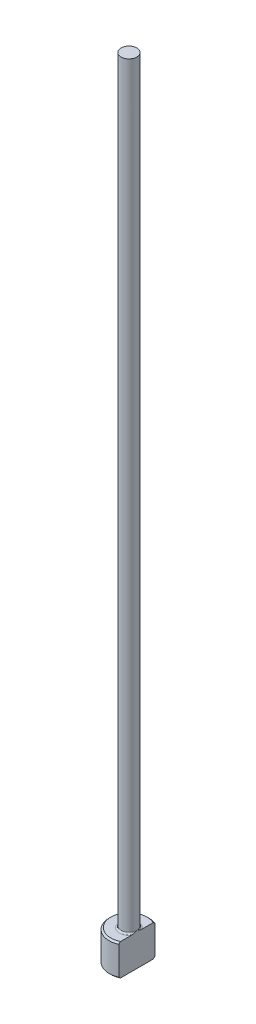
ISO-10303-21;
HEADER;
FILE_DESCRIPTION(('STEP AP214'),'2;1');
FILE_NAME('part.step','',(''),(''),'','','');
FILE_SCHEMA(('AUTOMOTIVE_DESIGN { 1 0 10303 214 1 1 1 1 }'));
ENDSEC;
DATA;
#1=APPLICATION_CONTEXT('core data for automotive mechanical design processes');
#2=APPLICATION_PROTOCOL_DEFINITION('international standard','automotive_design',2000,#1);
#3=PRODUCT_CONTEXT('',#1,'mechanical');
#4=PRODUCT('Part','Part','',(#3));
#5=PRODUCT_RELATED_PRODUCT_CATEGORY('part','',(#4));
#6=PRODUCT_DEFINITION_FORMATION('','',#4);
#7=PRODUCT_DEFINITION_CONTEXT('part definition',#1,'design');
#8=PRODUCT_DEFINITION('design','',#6,#7);
#9=PRODUCT_DEFINITION_SHAPE('','',#8);
#10=(LENGTH_UNIT() NAMED_UNIT(*) SI_UNIT(.MILLI.,.METRE.));
#11=(NAMED_UNIT(*) PLANE_ANGLE_UNIT() SI_UNIT($,.RADIAN.));
#12=(NAMED_UNIT(*) SI_UNIT($,.STERADIAN.) SOLID_ANGLE_UNIT());
#13=UNCERTAINTY_MEASURE_WITH_UNIT(LENGTH_MEASURE(1.E-05),#10,'distance_accuracy_value','');
#14=(GEOMETRIC_REPRESENTATION_CONTEXT(3) GLOBAL_UNCERTAINTY_ASSIGNED_CONTEXT((#13)) GLOBAL_UNIT_ASSIGNED_CONTEXT((#10,
#11,#12)) REPRESENTATION_CONTEXT('',''));
#15=CARTESIAN_POINT('',(0.,0.,0.));
#16=DIRECTION('',(0.,0.,1.));
#17=DIRECTION('',(1.,0.,0.));
#18=AXIS2_PLACEMENT_3D('',#15,#16,#17);
#19=CARTESIAN_POINT('',(0.,0.,0.));
#20=DIRECTION('',(0.,-1.,0.));
#21=DIRECTION('',(0.,0.,-1.));
#22=AXIS2_PLACEMENT_3D('',#19,#20,#21);
#23=PLANE('',#22);
#24=CARTESIAN_POINT('',(0.,0.,0.));
#25=DIRECTION('',(0.,-1.,0.));
#26=DIRECTION('',(0.,0.,-1.));
#27=AXIS2_PLACEMENT_3D('',#24,#25,#26);
#28=CIRCLE('',#27,2.29999999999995);
#29=CARTESIAN_POINT('',(0.999999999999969,0.,2.07123151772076));
#30=VERTEX_POINT('',#29);
#31=CARTESIAN_POINT('',(0.999999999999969,0.,-2.07123151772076));
#32=VERTEX_POINT('',#31);
#33=EDGE_CURVE('E98',#30,#32,#28,.T.);
#34=ORIENTED_EDGE('',*,*,#33,.T.);
#35=DIRECTION('',(0.,0.,1.));
#36=VECTOR('',#35,1.);
#37=CARTESIAN_POINT('',(0.999999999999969,0.,2.2912878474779));
#38=LINE('',#37,#36);
#39=EDGE_CURVE('E83',#32,#30,#38,.T.);
#40=ORIENTED_EDGE('',*,*,#39,.T.);
#41=EDGE_LOOP('',(#34,#40));
#42=FACE_BOUND('',#41,.T.);
#43=ADVANCED_FACE('F32',(#42),#23,.T.);
#44=CARTESIAN_POINT('',(0.,259.958771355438,0.));
#45=DIRECTION('',(0.,1.,0.));
#46=DIRECTION('',(0.,0.,1.));
#47=AXIS2_PLACEMENT_3D('',#44,#45,#46);
#48=CYLINDRICAL_SURFACE('',#47,2.49999999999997);
#49=CARTESIAN_POINT('',(0.,3.80000000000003,0.));
#50=DIRECTION('',(0.,1.,0.));
#51=DIRECTION('',(0.,0.,1.));
#52=AXIS2_PLACEMENT_3D('',#49,#50,#51);
#53=CIRCLE('',#52,2.49999999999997);
#54=CARTESIAN_POINT('',(0.999999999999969,3.80000000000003,2.2912878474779));
#55=VERTEX_POINT('',#54);
#56=CARTESIAN_POINT('',(0.999999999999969,3.80000000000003,-2.2912878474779));
#57=VERTEX_POINT('',#56);
#58=EDGE_CURVE('E104',#55,#57,#53,.F.);
#59=ORIENTED_EDGE('',*,*,#58,.T.);
#60=DIRECTION('',(0.,-1.,0.));
#61=VECTOR('',#60,1.);
#62=CARTESIAN_POINT('',(0.999999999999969,100.,-2.2912878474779));
#63=LINE('',#62,#61);
#64=CARTESIAN_POINT('',(0.999999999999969,0.200000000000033,-2.2912878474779));
#65=VERTEX_POINT('',#64);
#66=EDGE_CURVE('E183',#57,#65,#63,.T.);
#67=ORIENTED_EDGE('',*,*,#66,.T.);
#68=CARTESIAN_POINT('',(0.,0.200000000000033,0.));
#69=DIRECTION('',(0.,-1.,0.));
#70=DIRECTION('',(0.,0.,-1.));
#71=AXIS2_PLACEMENT_3D('',#68,#69,#70);
#72=CIRCLE('',#71,2.49999999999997);
#73=CARTESIAN_POINT('',(0.999999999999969,0.200000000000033,2.2912878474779));
#74=VERTEX_POINT('',#73);
#75=EDGE_CURVE('E100',#65,#74,#72,.F.);
#76=ORIENTED_EDGE('',*,*,#75,.T.);
#77=DIRECTION('',(0.,-1.,0.));
#78=VECTOR('',#77,1.);
#79=CARTESIAN_POINT('',(0.999999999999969,100.,2.2912878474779));
#80=LINE('',#79,#78);
#81=EDGE_CURVE('E93',#55,#74,#80,.T.);
#82=ORIENTED_EDGE('',*,*,#81,.F.);
#83=EDGE_LOOP('',(#59,#67,#76,#82));
#84=FACE_BOUND('',#83,.T.);
#85=ADVANCED_FACE('F158',(#84),#48,.T.);
#86=CARTESIAN_POINT('',(-2.49999999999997,4.,0.));
#87=DIRECTION('',(0.,1.,0.));
#88=DIRECTION('',(0.,0.,1.));
#89=AXIS2_PLACEMENT_3D('',#86,#87,#88);
#90=PLANE('',#89);
#91=CARTESIAN_POINT('',(0.,4.,0.));
#92=DIRECTION('',(0.,1.,0.));
#93=DIRECTION('',(0.,0.,1.));
#94=AXIS2_PLACEMENT_3D('',#91,#92,#93);
#95=CIRCLE('',#94,2.29999999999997);
#96=CARTESIAN_POINT('',(0.999999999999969,4.,-2.07123151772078));
#97=VERTEX_POINT('',#96);
#98=CARTESIAN_POINT('',(0.999999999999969,4.,2.07123151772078));
#99=VERTEX_POINT('',#98);
#100=EDGE_CURVE('E178',#97,#99,#95,.T.);
#101=ORIENTED_EDGE('',*,*,#100,.T.);
#102=DIRECTION('',(0.,0.,-1.));
#103=VECTOR('',#102,1.);
#104=CARTESIAN_POINT('',(0.999999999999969,4.,0.));
#105=LINE('',#104,#103);
#106=CARTESIAN_POINT('',(0.999999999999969,3.99999999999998,0.663324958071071));
#107=VERTEX_POINT('',#106);
#108=EDGE_CURVE('E57',#99,#107,#105,.T.);
#109=ORIENTED_EDGE('',*,*,#108,.T.);
#110=CARTESIAN_POINT('',(0.,4.,0.));
#111=DIRECTION('',(0.,1.,0.));
#112=DIRECTION('',(0.,0.,1.));
#113=AXIS2_PLACEMENT_3D('',#110,#111,#112);
#114=CIRCLE('',#113,1.19999999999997);
#115=CARTESIAN_POINT('',(0.999999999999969,3.99999999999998,-0.663324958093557));
#116=VERTEX_POINT('',#115);
#117=EDGE_CURVE('E107',#107,#116,#114,.F.);
#118=ORIENTED_EDGE('',*,*,#117,.T.);
#119=EDGE_CURVE('E136',#116,#97,#105,.T.);
#120=ORIENTED_EDGE('',*,*,#119,.T.);
#121=EDGE_LOOP('',(#101,#109,#118,#120));
#122=FACE_BOUND('',#121,.T.);
#123=ADVANCED_FACE('F147',(#122),#90,.T.);
#124=CARTESIAN_POINT('',(0.,4.,0.));
#125=DIRECTION('',(0.,-1.,0.));
#126=DIRECTION('',(0.,0.,-1.));
#127=AXIS2_PLACEMENT_3D('',#124,#125,#126);
#128=CONICAL_SURFACE('',#127,2.29999999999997,0.785398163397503);
#129=ORIENTED_EDGE('',*,*,#58,.F.);
#130=CARTESIAN_POINT('',(0.999999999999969,1.15817039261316,5.043650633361));
#131=CARTESIAN_POINT('',(0.999999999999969,1.28171614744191,4.91769392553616));
#132=CARTESIAN_POINT('',(0.999999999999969,1.40517853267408,4.79165523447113));
#133=CARTESIAN_POINT('',(0.999999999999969,1.65205736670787,4.5391725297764));
#134=CARTESIAN_POINT('',(0.999999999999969,1.77547348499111,4.4127281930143));
#135=CARTESIAN_POINT('',(0.999999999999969,2.02507999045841,4.1564175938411));
#136=CARTESIAN_POINT('',(0.999999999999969,2.15126317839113,4.02654431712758));
#137=CARTESIAN_POINT('',(0.999999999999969,2.40304621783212,3.76660249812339));
#138=CARTESIAN_POINT('',(0.999999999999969,2.52864665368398,3.63653452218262));
#139=CARTESIAN_POINT('',(0.999999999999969,2.76776970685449,3.38787610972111));
#140=CARTESIAN_POINT('',(0.999999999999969,2.88133977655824,3.26933134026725));
#141=CARTESIAN_POINT('',(0.999999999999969,3.10787167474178,3.03166264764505));
#142=CARTESIAN_POINT('',(0.999999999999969,3.22083350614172,2.91253872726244));
#143=CARTESIAN_POINT('',(0.999999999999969,3.44656995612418,2.67277252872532));
#144=CARTESIAN_POINT('',(0.999999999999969,3.5593394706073,2.55212543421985));
#145=CARTESIAN_POINT('',(0.999999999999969,3.78351625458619,2.30972256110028));
#146=CARTESIAN_POINT('',(0.999999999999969,3.89492439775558,2.18796759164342));
#147=CARTESIAN_POINT('',(0.999999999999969,4.1131873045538,1.9454858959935));
#148=CARTESIAN_POINT('',(0.999999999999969,4.2200877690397,1.82480064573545));
#149=CARTESIAN_POINT('',(0.999999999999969,4.37813361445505,1.64149718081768));
#150=CARTESIAN_POINT('',(0.999999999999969,4.43049954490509,1.57993333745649));
#151=CARTESIAN_POINT('',(0.999999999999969,4.53410631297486,1.45586813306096));
#152=CARTESIAN_POINT('',(0.999999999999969,4.58534721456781,1.39336682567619));
#153=CARTESIAN_POINT('',(0.999999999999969,4.68568582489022,1.26783988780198));
#154=CARTESIAN_POINT('',(0.999999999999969,4.73480144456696,1.20482863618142));
#155=CARTESIAN_POINT('',(0.999999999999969,4.83086890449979,1.07709082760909));
#156=CARTESIAN_POINT('',(0.999999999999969,4.87781921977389,1.01236311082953));
#157=CARTESIAN_POINT('',(0.999999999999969,4.96818560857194,0.880911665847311));
#158=CARTESIAN_POINT('',(0.999999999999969,5.01161706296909,0.814198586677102));
#159=CARTESIAN_POINT('',(0.999999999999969,5.09325231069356,0.677671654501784));
#160=CARTESIAN_POINT('',(0.999999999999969,5.1314648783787,0.60786327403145));
#161=CARTESIAN_POINT('',(0.999999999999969,5.1726089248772,0.520757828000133));
#162=CARTESIAN_POINT('',(0.999999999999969,5.17963219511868,0.505387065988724));
#163=CARTESIAN_POINT('',(0.999999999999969,5.19324475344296,0.474448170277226));
#164=CARTESIAN_POINT('',(0.999999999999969,5.19983388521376,0.458879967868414));
#165=CARTESIAN_POINT('',(0.999999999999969,5.21887613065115,0.411884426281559));
#166=CARTESIAN_POINT('',(0.999999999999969,5.23060772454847,0.380158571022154));
#167=CARTESIAN_POINT('',(0.999999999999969,5.25156131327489,0.316410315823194));
#168=CARTESIAN_POINT('',(0.999999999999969,5.26081845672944,0.284399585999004));
#169=CARTESIAN_POINT('',(0.999999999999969,5.2766313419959,0.21969696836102));
#170=CARTESIAN_POINT('',(0.999999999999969,5.2831862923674,0.187004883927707));
#171=CARTESIAN_POINT('',(0.999999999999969,5.29332210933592,0.120434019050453));
#172=CARTESIAN_POINT('',(0.999999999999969,5.29683603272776,0.0865448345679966));
#173=CARTESIAN_POINT('',(0.999999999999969,5.30040235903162,0.018593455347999));
#174=CARTESIAN_POINT('',(0.999999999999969,5.30045600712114,-0.0154686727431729));
#175=CARTESIAN_POINT('',(0.999999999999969,5.29709918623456,-0.0834515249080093));
#176=CARTESIAN_POINT('',(0.999999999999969,5.29368537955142,-0.117372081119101));
#177=CARTESIAN_POINT('',(0.999999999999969,5.28362616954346,-0.184734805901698));
#178=CARTESIAN_POINT('',(0.999999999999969,5.27697933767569,-0.218176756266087));
#179=CARTESIAN_POINT('',(0.999999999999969,5.25861838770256,-0.293522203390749));
#180=CARTESIAN_POINT('',(0.999999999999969,5.24601100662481,-0.335206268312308));
#181=CARTESIAN_POINT('',(0.999999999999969,5.21711806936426,-0.417267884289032));
#182=CARTESIAN_POINT('',(0.999999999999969,5.20083078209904,-0.457644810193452));
#183=CARTESIAN_POINT('',(0.999999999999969,5.16531625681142,-0.53739243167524));
#184=CARTESIAN_POINT('',(0.999999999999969,5.14606996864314,-0.576754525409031));
#185=CARTESIAN_POINT('',(0.999999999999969,5.10541239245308,-0.654316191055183));
#186=CARTESIAN_POINT('',(0.999999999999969,5.08400173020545,-0.692516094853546));
#187=CARTESIAN_POINT('',(0.999999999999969,5.03811272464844,-0.770330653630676));
#188=CARTESIAN_POINT('',(0.999999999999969,5.01352589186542,-0.809880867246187));
#189=CARTESIAN_POINT('',(0.999999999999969,4.96292539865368,-0.888061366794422));
#190=CARTESIAN_POINT('',(0.999999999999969,4.93691146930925,-0.926691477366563));
#191=CARTESIAN_POINT('',(0.999999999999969,4.85720012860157,-1.04150369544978));
#192=CARTESIAN_POINT('',(0.999999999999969,4.80186935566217,-1.11654866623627));
#193=CARTESIAN_POINT('',(0.999999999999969,4.68838315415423,-1.26473866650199));
#194=CARTESIAN_POINT('',(0.999999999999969,4.63022092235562,-1.33787839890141));
#195=CARTESIAN_POINT('',(0.999999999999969,4.51208910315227,-1.48269245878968));
#196=CARTESIAN_POINT('',(0.999999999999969,4.45211930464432,-1.55436661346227));
#197=CARTESIAN_POINT('',(0.999999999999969,4.33067987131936,-1.69694421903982));
#198=CARTESIAN_POINT('',(0.999999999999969,4.26920502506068,-1.76784320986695));
#199=CARTESIAN_POINT('',(0.999999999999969,4.14533845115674,-1.90884637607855));
#200=CARTESIAN_POINT('',(0.999999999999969,4.08294663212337,-1.978950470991));
#201=CARTESIAN_POINT('',(0.999999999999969,3.89498664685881,-2.18811918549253));
#202=CARTESIAN_POINT('',(0.999999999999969,3.76842113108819,-2.32628638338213));
#203=CARTESIAN_POINT('',(0.999999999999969,3.53875468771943,-2.57413295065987));
#204=CARTESIAN_POINT('',(0.999999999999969,3.43593273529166,-2.68407249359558));
#205=CARTESIAN_POINT('',(0.999999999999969,3.22955977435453,-2.90326847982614));
#206=CARTESIAN_POINT('',(0.999999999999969,3.12600875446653,-3.01252491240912));
#207=CARTESIAN_POINT('',(0.999999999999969,2.81444279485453,-3.33969806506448));
#208=CARTESIAN_POINT('',(0.999999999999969,2.60565048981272,-3.55687358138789));
#209=CARTESIAN_POINT('',(0.999999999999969,2.19072410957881,-3.98610808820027));
#210=CARTESIAN_POINT('',(0.999999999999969,1.98461149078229,-4.19818787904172));
#211=CARTESIAN_POINT('',(0.999999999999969,1.67496695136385,-4.51569174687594));
#212=CARTESIAN_POINT('',(0.999999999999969,1.57171087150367,-4.62138500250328));
#213=CARTESIAN_POINT('',(0.999999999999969,1.36504682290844,-4.83262218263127));
#214=CARTESIAN_POINT('',(0.999999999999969,1.26163885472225,-4.93816610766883));
#215=CARTESIAN_POINT('',(0.999999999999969,1.15817039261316,-5.043650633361));
#216=B_SPLINE_CURVE_WITH_KNOTS('',3,(#130,#131,#132,#133,#134,#135,#136,#137,#138,#139,#140,
#141,#142,#143,#144,#145,#146,#147,#148,#149,#150,#151,#152,#153,#154,#155,#156,#157,#158,#159,
#160,#161,#162,#163,#164,#165,#166,#167,#168,#169,#170,#171,#172,#173,#174,#175,#176,#177,#178,
#179,#180,#181,#182,#183,#184,#185,#186,#187,#188,#189,#190,#191,#192,#193,#194,#195,#196,#197,
#198,#199,#200,#201,#202,#203,#204,#205,#206,#207,#208,#209,#210,#211,#212,#213,#214,#215),
.UNSPECIFIED.,.F.,.F.,(4,2,2,2,2,2,2,2,2,2,2,2,2,2,2,2,2,2,2,2,2,2,2,2,2,2,2,2,2,2,2,2,2,2,2,2,
2,2,2,2,2,2,4),(0.,0.529299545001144,1.0593722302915,1.60260578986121,2.14504205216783,
2.63754347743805,3.13004253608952,3.62546908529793,4.12055895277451,4.60418442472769,
4.84664313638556,5.08908802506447,5.32873451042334,5.56854727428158,5.80724786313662,
6.04554205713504,6.09623410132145,6.14694429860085,6.24833951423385,6.34820702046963,
6.44810375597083,6.55014736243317,6.6521542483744,6.75425941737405,6.85640974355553,
6.98682841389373,7.11730856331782,7.24866693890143,7.37998744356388,7.51965621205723,
7.65935139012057,7.93894909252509,8.21925538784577,8.49959454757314,8.78110270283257,
9.06263910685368,9.62473592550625,10.0763211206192,10.5279133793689,11.4316934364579,
12.3189018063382,12.7621802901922,13.2054571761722),.UNSPECIFIED.);
#217=EDGE_CURVE('E135',#55,#99,#216,.T.);
#218=ORIENTED_EDGE('',*,*,#217,.T.);
#219=ORIENTED_EDGE('',*,*,#100,.F.);
#220=EDGE_CURVE('E127',#97,#57,#216,.T.);
#221=ORIENTED_EDGE('',*,*,#220,.T.);
#222=EDGE_LOOP('',(#129,#218,#219,#221));
#223=FACE_BOUND('',#222,.T.);
#224=ADVANCED_FACE('F143',(#223),#128,.T.);
#225=CARTESIAN_POINT('',(0.,0.200000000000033,0.));
#226=DIRECTION('',(0.,1.,0.));
#227=DIRECTION('',(0.,0.,1.));
#228=AXIS2_PLACEMENT_3D('',#225,#226,#227);
#229=CONICAL_SURFACE('',#228,2.49999999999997,0.785398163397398);
#230=ORIENTED_EDGE('',*,*,#75,.F.);
#231=CARTESIAN_POINT('',(0.999999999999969,2.84182960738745,-5.043650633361));
#232=CARTESIAN_POINT('',(0.999999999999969,2.71828385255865,-4.91769392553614));
#233=CARTESIAN_POINT('',(0.999999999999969,2.59482146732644,-4.79165523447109));
#234=CARTESIAN_POINT('',(0.999999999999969,2.34794263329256,-4.53917252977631));
#235=CARTESIAN_POINT('',(0.999999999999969,2.22452651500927,-4.4127281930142));
#236=CARTESIAN_POINT('',(0.999999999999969,1.97492000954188,-4.15641759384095));
#237=CARTESIAN_POINT('',(0.999999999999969,1.84873682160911,-4.02654431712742));
#238=CARTESIAN_POINT('',(0.999999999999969,1.59695378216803,-3.76660249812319));
#239=CARTESIAN_POINT('',(0.999999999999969,1.47135334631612,-3.63653452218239));
#240=CARTESIAN_POINT('',(0.999999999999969,1.23223029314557,-3.38787610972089));
#241=CARTESIAN_POINT('',(0.999999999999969,1.11866022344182,-3.26933134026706));
#242=CARTESIAN_POINT('',(0.999999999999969,0.89212832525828,-3.03166264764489));
#243=CARTESIAN_POINT('',(0.999999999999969,0.779166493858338,-2.91253872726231));
#244=CARTESIAN_POINT('',(0.999999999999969,0.553430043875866,-2.67277252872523));
#245=CARTESIAN_POINT('',(0.999999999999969,0.440660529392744,-2.55212543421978));
#246=CARTESIAN_POINT('',(0.999999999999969,0.216483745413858,-2.30972256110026));
#247=CARTESIAN_POINT('',(0.999999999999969,0.105075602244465,-2.18796759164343));
#248=CARTESIAN_POINT('',(0.999999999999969,-0.113187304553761,-1.94548589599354));
#249=CARTESIAN_POINT('',(0.999999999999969,-0.220087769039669,-1.82480064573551));
#250=CARTESIAN_POINT('',(0.999999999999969,-0.378133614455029,-1.64149718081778));
#251=CARTESIAN_POINT('',(0.999999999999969,-0.430499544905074,-1.57993333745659));
#252=CARTESIAN_POINT('',(0.999999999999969,-0.534106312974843,-1.45586813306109));
#253=CARTESIAN_POINT('',(0.999999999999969,-0.585347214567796,-1.39336682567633));
#254=CARTESIAN_POINT('',(0.999999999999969,-0.685685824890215,-1.26783988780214));
#255=CARTESIAN_POINT('',(0.999999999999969,-0.734801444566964,-1.20482863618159));
#256=CARTESIAN_POINT('',(0.999999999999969,-0.830868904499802,-1.07709082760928));
#257=CARTESIAN_POINT('',(0.999999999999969,-0.877819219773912,-1.01236311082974));
#258=CARTESIAN_POINT('',(0.999999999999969,-0.968185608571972,-0.880911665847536));
#259=CARTESIAN_POINT('',(0.999999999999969,-1.01161706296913,-0.814198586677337));
#260=CARTESIAN_POINT('',(0.999999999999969,-1.09325231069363,-0.677671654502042));
#261=CARTESIAN_POINT('',(0.999999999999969,-1.13146487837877,-0.60786327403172));
#262=CARTESIAN_POINT('',(0.999999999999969,-1.17260892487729,-0.520757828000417));
#263=CARTESIAN_POINT('',(0.999999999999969,-1.17963219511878,-0.505387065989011));
#264=CARTESIAN_POINT('',(0.999999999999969,-1.19324475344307,-0.474448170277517));
#265=CARTESIAN_POINT('',(0.999999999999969,-1.19983388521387,-0.458879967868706));
#266=CARTESIAN_POINT('',(0.999999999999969,-1.21887613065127,-0.411884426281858));
#267=CARTESIAN_POINT('',(0.999999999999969,-1.23060772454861,-0.380158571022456));
#268=CARTESIAN_POINT('',(0.999999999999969,-1.25156131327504,-0.316410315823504));
#269=CARTESIAN_POINT('',(0.999999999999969,-1.2608184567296,-0.284399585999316));
#270=CARTESIAN_POINT('',(0.999999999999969,-1.27663134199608,-0.219696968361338));
#271=CARTESIAN_POINT('',(0.999999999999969,-1.28318629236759,-0.187004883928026));
#272=CARTESIAN_POINT('',(0.999999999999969,-1.29332210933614,-0.120434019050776));
#273=CARTESIAN_POINT('',(0.999999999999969,-1.29683603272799,-0.0865448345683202));
#274=CARTESIAN_POINT('',(0.999999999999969,-1.30040235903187,-0.0185934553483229));
#275=CARTESIAN_POINT('',(0.999999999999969,-1.3004560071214,0.0154686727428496));
#276=CARTESIAN_POINT('',(0.999999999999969,-1.29709918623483,0.083451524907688));
#277=CARTESIAN_POINT('',(0.999999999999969,-1.29368537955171,0.117372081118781));
#278=CARTESIAN_POINT('',(0.999999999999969,-1.28362616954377,0.184734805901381));
#279=CARTESIAN_POINT('',(0.999999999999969,-1.27697933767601,0.218176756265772));
#280=CARTESIAN_POINT('',(0.999999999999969,-1.2586183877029,0.293522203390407));
#281=CARTESIAN_POINT('',(0.999999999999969,-1.24601100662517,0.335206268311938));
#282=CARTESIAN_POINT('',(0.999999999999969,-1.21711806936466,0.417267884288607));
#283=CARTESIAN_POINT('',(0.999999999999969,-1.20083078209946,0.457644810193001));
#284=CARTESIAN_POINT('',(0.999999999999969,-1.16531625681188,0.537392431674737));
#285=CARTESIAN_POINT('',(0.999999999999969,-1.14606996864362,0.576754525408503));
#286=CARTESIAN_POINT('',(0.999999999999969,-1.10541239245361,0.654316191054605));
#287=CARTESIAN_POINT('',(0.999999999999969,-1.084001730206,0.692516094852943));
#288=CARTESIAN_POINT('',(0.999999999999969,-1.03811272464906,0.770330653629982));
#289=CARTESIAN_POINT('',(0.999999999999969,-1.01352589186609,0.809880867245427));
#290=CARTESIAN_POINT('',(0.999999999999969,-0.962925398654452,0.888061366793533));
#291=CARTESIAN_POINT('',(0.999999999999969,-0.936911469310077,0.926691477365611));
#292=CARTESIAN_POINT('',(0.999999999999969,-0.857200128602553,1.04150369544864));
#293=CARTESIAN_POINT('',(0.999999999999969,-0.801869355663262,1.11654866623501));
#294=CARTESIAN_POINT('',(0.999999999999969,-0.688383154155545,1.26473866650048));
#295=CARTESIAN_POINT('',(0.999999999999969,-0.63022092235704,1.33787839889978));
#296=CARTESIAN_POINT('',(0.999999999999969,-0.512089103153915,1.4826924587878));
#297=CARTESIAN_POINT('',(0.999999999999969,-0.452119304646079,1.55436661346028));
#298=CARTESIAN_POINT('',(0.999999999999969,-0.330679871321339,1.69694421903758));
#299=CARTESIAN_POINT('',(0.999999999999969,-0.26920502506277,1.76784320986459));
#300=CARTESIAN_POINT('',(0.999999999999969,-0.145338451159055,1.90884637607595));
#301=CARTESIAN_POINT('',(0.999999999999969,-0.0829466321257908,1.97895047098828));
#302=CARTESIAN_POINT('',(0.999999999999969,0.10501335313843,2.18811918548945));
#303=CARTESIAN_POINT('',(0.999999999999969,0.231578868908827,2.32628638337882));
#304=CARTESIAN_POINT('',(0.999999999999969,0.461245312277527,2.57413295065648));
#305=CARTESIAN_POINT('',(0.999999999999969,0.56406726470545,2.68407249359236));
#306=CARTESIAN_POINT('',(0.999999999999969,0.770440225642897,2.90326847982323));
#307=CARTESIAN_POINT('',(0.999999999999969,0.873991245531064,3.01252491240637));
#308=CARTESIAN_POINT('',(0.999999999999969,1.18555720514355,3.3396980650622));
#309=CARTESIAN_POINT('',(0.999999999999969,1.39434951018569,3.55687358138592));
#310=CARTESIAN_POINT('',(0.999999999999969,1.80927589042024,3.98610808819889));
#311=CARTESIAN_POINT('',(0.999999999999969,2.01538850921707,4.19818787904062));
#312=CARTESIAN_POINT('',(0.999999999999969,2.32503304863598,4.51569174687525));
#313=CARTESIAN_POINT('',(0.999999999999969,2.42828912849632,4.62138500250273));
#314=CARTESIAN_POINT('',(0.999999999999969,2.63495317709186,4.832622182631));
#315=CARTESIAN_POINT('',(0.999999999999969,2.73836114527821,4.9381661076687));
#316=CARTESIAN_POINT('',(0.999999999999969,2.84182960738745,5.043650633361));
#317=B_SPLINE_CURVE_WITH_KNOTS('',3,(#231,#232,#233,#234,#235,#236,#237,#238,#239,#240,#241,
#242,#243,#244,#245,#246,#247,#248,#249,#250,#251,#252,#253,#254,#255,#256,#257,#258,#259,#260,
#261,#262,#263,#264,#265,#266,#267,#268,#269,#270,#271,#272,#273,#274,#275,#276,#277,#278,#279,
#280,#281,#282,#283,#284,#285,#286,#287,#288,#289,#290,#291,#292,#293,#294,#295,#296,#297,#298,
#299,#300,#301,#302,#303,#304,#305,#306,#307,#308,#309,#310,#311,#312,#313,#314,#315,#316),
.UNSPECIFIED.,.F.,.F.,(4,2,2,2,2,2,2,2,2,2,2,2,2,2,2,2,2,2,2,2,2,2,2,2,2,2,2,2,2,2,2,2,2,2,2,2,
2,2,2,2,2,2,4),(0.,0.529299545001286,1.05937223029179,1.60260578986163,2.14504205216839,
2.63754347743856,3.13004253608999,3.62546908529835,4.12055895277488,4.60418442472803,
4.84664313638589,5.08908802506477,5.32873451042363,5.56854727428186,5.80724786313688,
6.04554205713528,6.0962341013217,6.14694429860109,6.24833951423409,6.34820702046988,
6.44810375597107,6.55014736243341,6.65215424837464,6.75425941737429,6.85640974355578,
6.98682841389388,7.11730856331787,7.24866693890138,7.37998744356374,7.51965621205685,
7.65935139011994,7.93894909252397,8.21925538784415,8.49959454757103,8.78110270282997,
9.06263910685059,9.62473592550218,10.0763211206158,10.5279133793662,11.4316934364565,
12.3189018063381,12.7621802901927,13.2054571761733),.UNSPECIFIED.);
#318=EDGE_CURVE('E86',#65,#32,#317,.T.);
#319=ORIENTED_EDGE('',*,*,#318,.T.);
#320=ORIENTED_EDGE('',*,*,#33,.F.);
#321=EDGE_CURVE('E89',#30,#74,#317,.T.);
#322=ORIENTED_EDGE('',*,*,#321,.T.);
#323=EDGE_LOOP('',(#230,#319,#320,#322));
#324=FACE_BOUND('',#323,.T.);
#325=ADVANCED_FACE('F97',(#324),#229,.T.);
#326=CARTESIAN_POINT('',(0.,4.19999999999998,0.));
#327=DIRECTION('',(0.,1.,0.));
#328=DIRECTION('',(0.,0.,1.));
#329=AXIS2_PLACEMENT_3D('',#326,#327,#328);
#330=TOROIDAL_SURFACE('',#329,1.19999999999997,0.2);
#331=CARTESIAN_POINT('',(0.999999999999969,4.19999999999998,0.));
#332=CARTESIAN_POINT('',(0.999999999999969,4.20000051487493,2.59065974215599E-12));
#333=CARTESIAN_POINT('',(0.999999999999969,4.20000102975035,-9.42496361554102E-08));
#334=CARTESIAN_POINT('',(0.999999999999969,4.20000202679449,-4.00799852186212E-07));
#335=CARTESIAN_POINT('',(0.999999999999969,4.20000250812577,-6.15372282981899E-07));
#336=CARTESIAN_POINT('',(0.999999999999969,4.20000346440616,-1.13351403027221E-06));
#337=CARTESIAN_POINT('',(0.999999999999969,4.20000393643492,-1.44235226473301E-06));
#338=CARTESIAN_POINT('',(0.999999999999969,4.20000483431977,-2.11388878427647E-06));
#339=CARTESIAN_POINT('',(0.999999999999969,4.20000526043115,-2.47625954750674E-06));
#340=CARTESIAN_POINT('',(0.999999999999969,4.20000666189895,-3.75794161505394E-06));
#341=CARTESIAN_POINT('',(0.999999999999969,4.2000075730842,-4.74818961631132E-06));
#342=CARTESIAN_POINT('',(0.999999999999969,4.20000922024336,-6.81289838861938E-06));
#343=CARTESIAN_POINT('',(0.999999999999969,4.20000996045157,-7.8841765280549E-06));
#344=CARTESIAN_POINT('',(0.999999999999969,4.20001267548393,-1.19907295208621E-05));
#345=CARTESIAN_POINT('',(0.999999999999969,4.20001450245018,-1.51274185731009E-05));
#346=CARTESIAN_POINT('',(0.999999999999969,4.20001755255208,-2.13715427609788E-05));
#347=CARTESIAN_POINT('',(0.999999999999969,4.20001881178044,-2.44620178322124E-05));
#348=CARTESIAN_POINT('',(0.999999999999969,4.20002404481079,-3.74145212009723E-05));
#349=CARTESIAN_POINT('',(0.999999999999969,4.20002793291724,-4.73052128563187E-05));
#350=CARTESIAN_POINT('',(0.999999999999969,4.2000342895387,-6.59457080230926E-05));
#351=CARTESIAN_POINT('',(0.999999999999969,4.20003688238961,-7.46515304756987E-05));
#352=CARTESIAN_POINT('',(0.999999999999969,4.20005709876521,-0.000137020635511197));
#353=CARTESIAN_POINT('',(0.999999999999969,4.20008244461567,-0.000187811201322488));
#354=CARTESIAN_POINT('',(0.999999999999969,4.20017671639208,-0.000384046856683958));
#355=CARTESIAN_POINT('',(0.999999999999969,4.2002399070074,-0.000531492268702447));
#356=CARTESIAN_POINT('',(0.999999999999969,4.20048701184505,-0.00109942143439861));
#357=CARTESIAN_POINT('',(0.999999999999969,4.20067693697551,-0.00151784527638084));
#358=CARTESIAN_POINT('',(0.999999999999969,4.20144296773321,-0.00321386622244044));
#359=CARTESIAN_POINT('',(0.999999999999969,4.20201230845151,-0.00449374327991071));
#360=CARTESIAN_POINT('',(0.999999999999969,4.20998444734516,-0.0224047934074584));
#361=CARTESIAN_POINT('',(0.999999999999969,4.2174352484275,-0.039020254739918));
#362=CARTESIAN_POINT('',(0.999999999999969,4.23197002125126,-0.0717084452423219));
#363=CARTESIAN_POINT('',(0.999999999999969,4.23905766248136,-0.0877796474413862));
#364=CARTESIAN_POINT('',(0.999999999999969,4.25389009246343,-0.121781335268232));
#365=CARTESIAN_POINT('',(0.999999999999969,4.26161964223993,-0.139718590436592));
#366=CARTESIAN_POINT('',(0.999999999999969,4.27689168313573,-0.175878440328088));
#367=CARTESIAN_POINT('',(0.999999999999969,4.28443162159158,-0.19410211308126));
#368=CARTESIAN_POINT('',(0.999999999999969,4.30282726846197,-0.239840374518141));
#369=CARTESIAN_POINT('',(0.999999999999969,4.31345710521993,-0.267447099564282));
#370=CARTESIAN_POINT('',(0.999999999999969,4.33331094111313,-0.322481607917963));
#371=CARTESIAN_POINT('',(0.999999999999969,4.34256072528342,-0.349899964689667));
#372=CARTESIAN_POINT('',(0.999999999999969,4.35732089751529,-0.398044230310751));
#373=CARTESIAN_POINT('',(0.999999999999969,4.36317895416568,-0.418661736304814));
#374=CARTESIAN_POINT('',(0.999999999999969,4.37387907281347,-0.460275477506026));
#375=CARTESIAN_POINT('',(0.999999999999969,4.37871519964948,-0.48127319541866));
#376=CARTESIAN_POINT('',(0.999999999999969,4.39174175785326,-0.546853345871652));
#377=CARTESIAN_POINT('',(0.999999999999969,4.39776253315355,-0.591947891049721));
#378=CARTESIAN_POINT('',(0.999999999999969,4.400401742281,-0.660990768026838));
#379=CARTESIAN_POINT('',(0.999999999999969,4.400126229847,-0.684818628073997));
#380=CARTESIAN_POINT('',(0.999999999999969,4.39660783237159,-0.732027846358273));
#381=CARTESIAN_POINT('',(0.999999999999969,4.39339826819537,-0.755411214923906));
#382=CARTESIAN_POINT('',(0.999999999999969,4.38447874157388,-0.796083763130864));
#383=CARTESIAN_POINT('',(0.999999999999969,4.37951676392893,-0.813533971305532));
#384=CARTESIAN_POINT('',(0.999999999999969,4.36698902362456,-0.847531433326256));
#385=CARTESIAN_POINT('',(0.999999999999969,4.35942232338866,-0.864078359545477));
#386=CARTESIAN_POINT('',(0.999999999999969,4.34431787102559,-0.890141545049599));
#387=CARTESIAN_POINT('',(0.999999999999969,4.33762931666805,-0.900148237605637));
#388=CARTESIAN_POINT('',(0.999999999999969,4.32281345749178,-0.919033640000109));
#389=CARTESIAN_POINT('',(0.999999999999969,4.3146887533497,-0.92791433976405));
#390=CARTESIAN_POINT('',(0.999999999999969,4.29878569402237,-0.942427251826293));
#391=CARTESIAN_POINT('',(0.999999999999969,4.29127620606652,-0.948352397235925));
#392=CARTESIAN_POINT('',(0.999999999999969,4.27538509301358,-0.958904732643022));
#393=CARTESIAN_POINT('',(0.999999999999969,4.26700378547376,-0.963532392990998));
#394=CARTESIAN_POINT('',(0.999999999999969,4.24944905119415,-0.971220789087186));
#395=CARTESIAN_POINT('',(0.999999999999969,4.24026913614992,-0.974266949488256));
#396=CARTESIAN_POINT('',(0.999999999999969,4.22148612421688,-0.978466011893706));
#397=CARTESIAN_POINT('',(0.999999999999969,4.21188346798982,-0.979620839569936));
#398=CARTESIAN_POINT('',(0.999999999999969,4.19406751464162,-0.979911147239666));
#399=CARTESIAN_POINT('',(0.999999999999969,4.18585759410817,-0.979318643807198));
#400=CARTESIAN_POINT('',(0.999999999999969,4.16966497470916,-0.976727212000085));
#401=CARTESIAN_POINT('',(0.999999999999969,4.16168225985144,-0.97472838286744));
#402=CARTESIAN_POINT('',(0.999999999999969,4.14632905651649,-0.969513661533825));
#403=CARTESIAN_POINT('',(0.999999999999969,4.13894889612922,-0.966325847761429));
#404=CARTESIAN_POINT('',(0.999999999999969,4.12474145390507,-0.958901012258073));
#405=CARTESIAN_POINT('',(0.999999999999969,4.11791436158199,-0.954663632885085));
#406=CARTESIAN_POINT('',(0.999999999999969,4.10210888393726,-0.943323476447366));
#407=CARTESIAN_POINT('',(0.999999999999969,4.09345388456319,-0.935769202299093));
#408=CARTESIAN_POINT('',(0.999999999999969,4.07747441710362,-0.9193596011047));
#409=CARTESIAN_POINT('',(0.999999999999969,4.07015330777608,-0.910501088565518));
#410=CARTESIAN_POINT('',(0.999999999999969,4.05394486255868,-0.887884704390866));
#411=CARTESIAN_POINT('',(0.999999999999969,4.04572469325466,-0.873650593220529));
#412=CARTESIAN_POINT('',(0.999999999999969,4.03162462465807,-0.844119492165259));
#413=CARTESIAN_POINT('',(0.999999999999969,4.02574383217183,-0.828822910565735));
#414=CARTESIAN_POINT('',(0.999999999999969,4.01314628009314,-0.788605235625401));
#415=CARTESIAN_POINT('',(0.999999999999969,4.00790637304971,-0.763225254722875));
#416=CARTESIAN_POINT('',(0.999999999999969,4.00123778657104,-0.711706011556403));
#417=CARTESIAN_POINT('',(0.999999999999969,3.99986086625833,-0.685561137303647));
#418=CARTESIAN_POINT('',(0.999999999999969,4.00029138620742,-0.610897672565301));
#419=CARTESIAN_POINT('',(0.999999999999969,4.00583944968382,-0.562408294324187));
#420=CARTESIAN_POINT('',(0.999999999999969,4.01894675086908,-0.492015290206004));
#421=CARTESIAN_POINT('',(0.999999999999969,4.02392178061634,-0.469516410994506));
#422=CARTESIAN_POINT('',(0.999999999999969,4.03507986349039,-0.424950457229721));
#423=CARTESIAN_POINT('',(0.999999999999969,4.04125559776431,-0.402881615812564));
#424=CARTESIAN_POINT('',(0.999999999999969,4.05640318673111,-0.353063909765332));
#425=CARTESIAN_POINT('',(0.999999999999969,4.06567810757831,-0.32540920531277));
#426=CARTESIAN_POINT('',(0.999999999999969,4.08561584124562,-0.269900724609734));
#427=CARTESIAN_POINT('',(0.999999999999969,4.09630536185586,-0.242056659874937));
#428=CARTESIAN_POINT('',(0.999999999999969,4.11482832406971,-0.195905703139));
#429=CARTESIAN_POINT('',(0.999999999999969,4.12243033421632,-0.177504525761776));
#430=CARTESIAN_POINT('',(0.999999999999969,4.13783353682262,-0.140994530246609));
#431=CARTESIAN_POINT('',(0.999999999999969,4.14563210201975,-0.122884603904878));
#432=CARTESIAN_POINT('',(0.999999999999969,4.16059970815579,-0.0885577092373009));
#433=CARTESIAN_POINT('',(0.999999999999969,4.16775305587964,-0.0723337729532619));
#434=CARTESIAN_POINT('',(0.999999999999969,4.18242403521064,-0.039335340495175));
#435=CARTESIAN_POINT('',(0.999999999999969,4.18994542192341,-0.0225624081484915));
#436=CARTESIAN_POINT('',(0.999999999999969,4.19798770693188,-0.00449370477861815));
#437=CARTESIAN_POINT('',(0.999999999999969,4.19855706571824,-0.00321379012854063));
#438=CARTESIAN_POINT('',(0.999999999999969,4.19932310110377,-0.00151776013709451));
#439=CARTESIAN_POINT('',(0.999999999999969,4.19951301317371,-0.00109936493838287));
#440=CARTESIAN_POINT('',(0.999999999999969,4.19976010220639,-0.000531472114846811));
#441=CARTESIAN_POINT('',(0.999999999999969,4.19982328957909,-0.000384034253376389));
#442=CARTESIAN_POINT('',(0.999999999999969,4.19991755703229,-0.00018780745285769));
#443=CARTESIAN_POINT('',(0.999999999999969,4.19994290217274,-0.000137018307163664));
#444=CARTESIAN_POINT('',(0.999999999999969,4.19996311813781,-7.46508468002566E-05));
#445=CARTESIAN_POINT('',(0.999999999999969,4.19996571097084,-6.59451384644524E-05));
#446=CARTESIAN_POINT('',(0.999999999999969,4.19997206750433,-4.73048902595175E-05));
#447=CARTESIAN_POINT('',(0.999999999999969,4.19997595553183,-3.74143283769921E-05));
#448=CARTESIAN_POINT('',(0.999999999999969,4.19998118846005,-2.44619708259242E-05));
#449=CARTESIAN_POINT('',(0.999999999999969,4.19998244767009,-2.13715143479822E-05));
#450=CARTESIAN_POINT('',(0.999999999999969,4.19998549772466,-1.51274244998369E-05));
#451=CARTESIAN_POINT('',(0.999999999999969,4.19998732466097,-1.19907505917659E-05));
#452=CARTESIAN_POINT('',(0.999999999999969,4.19999003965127,-7.88421144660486E-06));
#453=CARTESIAN_POINT('',(0.999999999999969,4.19999077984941,-6.81293476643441E-06));
#454=CARTESIAN_POINT('',(0.999999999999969,4.19999242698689,-4.74822687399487E-06));
#455=CARTESIAN_POINT('',(0.999999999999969,4.19999333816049,-3.75797821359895E-06));
#456=CARTESIAN_POINT('',(0.999999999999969,4.19999473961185,-2.47629279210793E-06));
#457=CARTESIAN_POINT('',(0.999999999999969,4.19999516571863,-2.11392057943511E-06));
#458=CARTESIAN_POINT('',(0.999999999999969,4.19999606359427,-1.44238034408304E-06));
#459=CARTESIAN_POINT('',(0.999999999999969,4.19999653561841,-1.13353983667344E-06));
#460=CARTESIAN_POINT('',(0.999999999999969,4.1999974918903,-6.15392582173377E-07));
#461=CARTESIAN_POINT('',(0.999999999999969,4.19999797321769,-4.0081700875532E-07));
#462=CARTESIAN_POINT('',(0.999999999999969,4.19999897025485,-9.42592138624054E-08));
#463=CARTESIAN_POINT('',(0.999999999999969,4.19999948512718,-2.59064895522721E-12));
#464=CARTESIAN_POINT('',(0.999999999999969,4.19999999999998,0.));
#465=B_SPLINE_CURVE_WITH_KNOTS('',3,(#331,#332,#333,#334,#335,#336,#337,#338,#339,#340,#341,
#342,#343,#344,#345,#346,#347,#348,#349,#350,#351,#352,#353,#354,#355,#356,#357,#358,#359,#360,
#361,#362,#363,#364,#365,#366,#367,#368,#369,#370,#371,#372,#373,#374,#375,#376,#377,#378,#379,
#380,#381,#382,#383,#384,#385,#386,#387,#388,#389,#390,#391,#392,#393,#394,#395,#396,#397,#398,
#399,#400,#401,#402,#403,#404,#405,#406,#407,#408,#409,#410,#411,#412,#413,#414,#415,#416,#417,
#418,#419,#420,#421,#422,#423,#424,#425,#426,#427,#428,#429,#430,#431,#432,#433,#434,#435,#436,
#437,#438,#439,#440,#441,#442,#443,#444,#445,#446,#447,#448,#449,#450,#451,#452,#453,#454,#455,
#456,#457,#458,#459,#460,#461,#462,#463,#464),.UNSPECIFIED.,.T.,.F.,(4,2,2,2,2,2,2,2,2,2,2,2,2,
2,2,2,2,2,2,2,2,2,2,2,2,2,2,2,2,2,2,2,2,2,2,2,2,2,2,2,2,2,2,2,2,2,2,2,2,2,2,2,2,2,2,2,2,2,2,2,2,
2,2,2,2,2,4),(0.,1.54318091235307E-06,3.11656704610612E-06,4.80252014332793E-06,
6.4785555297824E-06,1.04956561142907E-05,1.4398891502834E-05,2.52504393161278E-05,
3.52518424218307E-05,6.71249457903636E-05,9.43496749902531E-05,0.000263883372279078,
0.000745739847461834,0.00212351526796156,0.00632669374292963,0.0609485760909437,
0.11364394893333,0.172237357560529,0.23140101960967,0.320129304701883,0.40690543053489,
0.471177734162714,0.535813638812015,0.67161710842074,0.742973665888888,0.813529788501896,
0.867802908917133,0.922095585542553,0.958095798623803,0.994031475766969,1.02261929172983,
1.05119673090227,1.08003306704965,1.1088400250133,1.1334101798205,1.15797860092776,
1.18200020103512,1.20602999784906,1.24030227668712,1.27465969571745,1.32369575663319,
1.37271307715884,1.45002425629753,1.52836647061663,1.67385288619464,1.74297459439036,
1.81168748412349,1.89915940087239,1.98861529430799,2.04834216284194,2.10749314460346,
2.16068730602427,2.21582681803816,2.22003012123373,2.221407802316,2.22188963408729,
2.2220591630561,2.22208638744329,2.22211826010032,2.22212826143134,2.22213911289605,
2.22214301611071,2.22214703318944,2.22214870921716,2.22215039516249,2.22215196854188,
2.22215351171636),.UNSPECIFIED.);
#466=CARTESIAN_POINT('',(0.999999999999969,4.19999999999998,0.));
#467=VERTEX_POINT('',#466);
#468=EDGE_CURVE('E11',#116,#467,#465,.T.);
#469=ORIENTED_EDGE('',*,*,#468,.F.);
#470=ORIENTED_EDGE('',*,*,#117,.F.);
#471=CARTESIAN_POINT('',(0.999999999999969,4.19999999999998,0.));
#472=CARTESIAN_POINT('',(0.999999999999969,4.19999948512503,-2.59066338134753E-12));
#473=CARTESIAN_POINT('',(0.999999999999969,4.19999897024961,9.42496361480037E-08));
#474=CARTESIAN_POINT('',(0.999999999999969,4.19999797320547,4.00799852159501E-07));
#475=CARTESIAN_POINT('',(0.999999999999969,4.19999749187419,6.15372282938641E-07));
#476=CARTESIAN_POINT('',(0.999999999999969,4.1999965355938,1.13351403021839E-06));
#477=CARTESIAN_POINT('',(0.999999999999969,4.19999606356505,1.44235226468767E-06));
#478=CARTESIAN_POINT('',(0.999999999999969,4.19999516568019,2.1138887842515E-06));
#479=CARTESIAN_POINT('',(0.999999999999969,4.19999473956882,2.47625954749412E-06));
#480=CARTESIAN_POINT('',(0.999999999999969,4.19999333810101,3.75794161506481E-06));
#481=CARTESIAN_POINT('',(0.999999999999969,4.19999242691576,4.74818961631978E-06));
#482=CARTESIAN_POINT('',(0.999999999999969,4.1999907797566,6.8128983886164E-06));
#483=CARTESIAN_POINT('',(0.999999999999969,4.19999003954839,7.88417652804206E-06));
#484=CARTESIAN_POINT('',(0.999999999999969,4.19998732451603,1.19907295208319E-05));
#485=CARTESIAN_POINT('',(0.999999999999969,4.19998549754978,1.5127418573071E-05));
#486=CARTESIAN_POINT('',(0.999999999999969,4.19998244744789,2.13715427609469E-05));
#487=CARTESIAN_POINT('',(0.999999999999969,4.19998118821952,2.44620178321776E-05));
#488=CARTESIAN_POINT('',(0.999999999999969,4.19997595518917,3.74145212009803E-05));
#489=CARTESIAN_POINT('',(0.999999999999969,4.19997206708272,4.73052128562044E-05));
#490=CARTESIAN_POINT('',(0.999999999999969,4.19996571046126,6.59457080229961E-05));
#491=CARTESIAN_POINT('',(0.999999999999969,4.19996311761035,7.46515304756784E-05));
#492=CARTESIAN_POINT('',(0.999999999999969,4.19994290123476,0.000137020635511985));
#493=CARTESIAN_POINT('',(0.999999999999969,4.19991755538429,0.000187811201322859));
#494=CARTESIAN_POINT('',(0.999999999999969,4.19982328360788,0.00038404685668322));
#495=CARTESIAN_POINT('',(0.999999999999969,4.19976009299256,0.000531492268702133));
#496=CARTESIAN_POINT('',(0.999999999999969,4.19951298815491,0.0010994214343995));
#497=CARTESIAN_POINT('',(0.999999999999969,4.19932306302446,0.00151784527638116));
#498=CARTESIAN_POINT('',(0.999999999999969,4.19855703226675,0.00321386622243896));
#499=CARTESIAN_POINT('',(0.999999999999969,4.19798769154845,0.00449374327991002));
#500=CARTESIAN_POINT('',(0.999999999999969,4.19001555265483,0.0224047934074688));
#501=CARTESIAN_POINT('',(0.999999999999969,4.18256475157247,0.0390202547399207));
#502=CARTESIAN_POINT('',(0.999999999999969,4.16802997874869,0.0717084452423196));
#503=CARTESIAN_POINT('',(0.999999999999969,4.1609423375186,0.0877796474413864));
#504=CARTESIAN_POINT('',(0.999999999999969,4.14610990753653,0.121781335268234));
#505=CARTESIAN_POINT('',(0.999999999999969,4.13838035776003,0.139718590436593));
#506=CARTESIAN_POINT('',(0.999999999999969,4.12310831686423,0.175878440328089));
#507=CARTESIAN_POINT('',(0.999999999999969,4.11556837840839,0.194102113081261));
#508=CARTESIAN_POINT('',(0.999999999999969,4.09717273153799,0.239840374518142));
#509=CARTESIAN_POINT('',(0.999999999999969,4.08654289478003,0.267447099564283));
#510=CARTESIAN_POINT('',(0.999999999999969,4.06668905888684,0.322481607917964));
#511=CARTESIAN_POINT('',(0.999999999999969,4.05743927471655,0.349899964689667));
#512=CARTESIAN_POINT('',(0.999999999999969,4.04267910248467,0.398044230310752));
#513=CARTESIAN_POINT('',(0.999999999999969,4.03682104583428,0.418661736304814));
#514=CARTESIAN_POINT('',(0.999999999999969,4.02612092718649,0.460275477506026));
#515=CARTESIAN_POINT('',(0.999999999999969,4.02128480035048,0.48127319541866));
#516=CARTESIAN_POINT('',(0.999999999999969,4.0082582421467,0.546853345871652));
#517=CARTESIAN_POINT('',(0.999999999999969,4.00223746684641,0.591947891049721));
#518=CARTESIAN_POINT('',(0.999999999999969,3.99959825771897,0.660990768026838));
#519=CARTESIAN_POINT('',(0.999999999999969,3.99987377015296,0.684818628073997));
#520=CARTESIAN_POINT('',(0.999999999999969,4.00339216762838,0.732027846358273));
#521=CARTESIAN_POINT('',(0.999999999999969,4.00660173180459,0.755411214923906));
#522=CARTESIAN_POINT('',(0.999999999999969,4.01552125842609,0.796083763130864));
#523=CARTESIAN_POINT('',(0.999999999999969,4.02048323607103,0.813533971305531));
#524=CARTESIAN_POINT('',(0.999999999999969,4.0330109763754,0.847531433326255));
#525=CARTESIAN_POINT('',(0.999999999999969,4.0405776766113,0.864078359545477));
#526=CARTESIAN_POINT('',(0.999999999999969,4.05568212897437,0.890141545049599));
#527=CARTESIAN_POINT('',(0.999999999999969,4.06237068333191,0.900148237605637));
#528=CARTESIAN_POINT('',(0.999999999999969,4.07718654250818,0.919033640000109));
#529=CARTESIAN_POINT('',(0.999999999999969,4.08531124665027,0.92791433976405));
#530=CARTESIAN_POINT('',(0.999999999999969,4.10121430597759,0.942427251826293));
#531=CARTESIAN_POINT('',(0.999999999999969,4.10872379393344,0.948352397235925));
#532=CARTESIAN_POINT('',(0.999999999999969,4.12461490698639,0.958904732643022));
#533=CARTESIAN_POINT('',(0.999999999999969,4.1329962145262,0.963532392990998));
#534=CARTESIAN_POINT('',(0.999999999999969,4.15055094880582,0.971220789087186));
#535=CARTESIAN_POINT('',(0.999999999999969,4.15973086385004,0.974266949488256));
#536=CARTESIAN_POINT('',(0.999999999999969,4.17851387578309,0.978466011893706));
#537=CARTESIAN_POINT('',(0.999999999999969,4.18811653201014,0.979620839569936));
#538=CARTESIAN_POINT('',(0.999999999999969,4.20593248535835,0.979911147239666));
#539=CARTESIAN_POINT('',(0.999999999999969,4.2141424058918,0.979318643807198));
#540=CARTESIAN_POINT('',(0.999999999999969,4.2303350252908,0.976727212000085));
#541=CARTESIAN_POINT('',(0.999999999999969,4.23831774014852,0.97472838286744));
#542=CARTESIAN_POINT('',(0.999999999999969,4.25367094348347,0.969513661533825));
#543=CARTESIAN_POINT('',(0.999999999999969,4.26105110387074,0.966325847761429));
#544=CARTESIAN_POINT('',(0.999999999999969,4.2752585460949,0.958901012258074));
#545=CARTESIAN_POINT('',(0.999999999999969,4.28208563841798,0.954663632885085));
#546=CARTESIAN_POINT('',(0.999999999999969,4.2978911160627,0.943323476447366));
#547=CARTESIAN_POINT('',(0.999999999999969,4.30654611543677,0.935769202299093));
#548=CARTESIAN_POINT('',(0.999999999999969,4.32252558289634,0.9193596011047));
#549=CARTESIAN_POINT('',(0.999999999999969,4.32984669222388,0.910501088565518));
#550=CARTESIAN_POINT('',(0.999999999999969,4.34605513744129,0.887884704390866));
#551=CARTESIAN_POINT('',(0.999999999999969,4.3542753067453,0.873650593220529));
#552=CARTESIAN_POINT('',(0.999999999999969,4.36837537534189,0.844119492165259));
#553=CARTESIAN_POINT('',(0.999999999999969,4.37425616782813,0.828822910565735));
#554=CARTESIAN_POINT('',(0.999999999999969,4.38685371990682,0.788605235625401));
#555=CARTESIAN_POINT('',(0.999999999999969,4.39209362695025,0.763225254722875));
#556=CARTESIAN_POINT('',(0.999999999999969,4.39876221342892,0.711706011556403));
#557=CARTESIAN_POINT('',(0.999999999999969,4.40013913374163,0.685561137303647));
#558=CARTESIAN_POINT('',(0.999999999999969,4.39970861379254,0.610897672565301));
#559=CARTESIAN_POINT('',(0.999999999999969,4.39416055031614,0.562408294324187));
#560=CARTESIAN_POINT('',(0.999999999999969,4.38105324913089,0.492015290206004));
#561=CARTESIAN_POINT('',(0.999999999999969,4.37607821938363,0.469516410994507));
#562=CARTESIAN_POINT('',(0.999999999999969,4.36492013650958,0.424950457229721));
#563=CARTESIAN_POINT('',(0.999999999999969,4.35874440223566,0.402881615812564));
#564=CARTESIAN_POINT('',(0.999999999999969,4.34359681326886,0.353063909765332));
#565=CARTESIAN_POINT('',(0.999999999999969,4.33432189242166,0.325409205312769));
#566=CARTESIAN_POINT('',(0.999999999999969,4.31438415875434,0.269900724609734));
#567=CARTESIAN_POINT('',(0.999999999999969,4.3036946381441,0.242056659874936));
#568=CARTESIAN_POINT('',(0.999999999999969,4.28517167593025,0.195905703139));
#569=CARTESIAN_POINT('',(0.999999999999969,4.27756966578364,0.177504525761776));
#570=CARTESIAN_POINT('',(0.999999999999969,4.26216646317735,0.140994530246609));
#571=CARTESIAN_POINT('',(0.999999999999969,4.25436789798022,0.122884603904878));
#572=CARTESIAN_POINT('',(0.999999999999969,4.23940029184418,0.0885577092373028));
#573=CARTESIAN_POINT('',(0.999999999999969,4.23224694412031,0.0723337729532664));
#574=CARTESIAN_POINT('',(0.999999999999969,4.21757596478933,0.0393353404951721));
#575=CARTESIAN_POINT('',(0.999999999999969,4.21005457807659,0.022562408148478));
#576=CARTESIAN_POINT('',(0.999999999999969,4.20201229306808,0.0044937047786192));
#577=CARTESIAN_POINT('',(0.999999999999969,4.20144293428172,0.00321379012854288));
#578=CARTESIAN_POINT('',(0.999999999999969,4.2006768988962,0.00151776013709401));
#579=CARTESIAN_POINT('',(0.999999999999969,4.20048698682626,0.0010993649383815));
#580=CARTESIAN_POINT('',(0.999999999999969,4.20023989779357,0.000531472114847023));
#581=CARTESIAN_POINT('',(0.999999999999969,4.20017671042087,0.000384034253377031));
#582=CARTESIAN_POINT('',(0.999999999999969,4.20008244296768,0.000187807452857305));
#583=CARTESIAN_POINT('',(0.999999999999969,4.20005709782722,0.000137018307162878));
#584=CARTESIAN_POINT('',(0.999999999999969,4.20003688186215,7.46508468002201E-05));
#585=CARTESIAN_POINT('',(0.999999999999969,4.20003428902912,6.59451384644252E-05));
#586=CARTESIAN_POINT('',(0.999999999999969,4.20002793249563,4.7304890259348E-05));
#587=CARTESIAN_POINT('',(0.999999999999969,4.20002404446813,3.74143283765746E-05));
#588=CARTESIAN_POINT('',(0.999999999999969,4.20001881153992,2.44619708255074E-05));
#589=CARTESIAN_POINT('',(0.999999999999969,4.20001755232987,2.13715143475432E-05));
#590=CARTESIAN_POINT('',(0.999999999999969,4.20001450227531,1.51274244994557E-05));
#591=CARTESIAN_POINT('',(0.999999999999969,4.20001267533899,1.19907505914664E-05));
#592=CARTESIAN_POINT('',(0.999999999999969,4.20000996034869,7.88421144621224E-06));
#593=CARTESIAN_POINT('',(0.999999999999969,4.20000922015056,6.8129347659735E-06));
#594=CARTESIAN_POINT('',(0.999999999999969,4.20000757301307,4.74822687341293E-06));
#595=CARTESIAN_POINT('',(0.999999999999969,4.20000666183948,3.75797821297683E-06));
#596=CARTESIAN_POINT('',(0.999999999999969,4.20000526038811,2.47629279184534E-06));
#597=CARTESIAN_POINT('',(0.999999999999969,4.20000483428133,2.11392057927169E-06));
#598=CARTESIAN_POINT('',(0.999999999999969,4.20000393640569,1.44238034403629E-06));
#599=CARTESIAN_POINT('',(0.999999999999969,4.20000346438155,1.1335398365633E-06));
#600=CARTESIAN_POINT('',(0.999999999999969,4.20000250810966,6.15392582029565E-07));
#601=CARTESIAN_POINT('',(0.999999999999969,4.20000202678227,4.00817008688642E-07));
#602=CARTESIAN_POINT('',(0.999999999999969,4.20000102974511,9.42592138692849E-08));
#603=CARTESIAN_POINT('',(0.999999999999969,4.20000051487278,2.59065259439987E-12));
#604=CARTESIAN_POINT('',(0.999999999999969,4.19999999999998,0.));
#605=B_SPLINE_CURVE_WITH_KNOTS('',3,(#471,#472,#473,#474,#475,#476,#477,#478,#479,#480,#481,
#482,#483,#484,#485,#486,#487,#488,#489,#490,#491,#492,#493,#494,#495,#496,#497,#498,#499,#500,
#501,#502,#503,#504,#505,#506,#507,#508,#509,#510,#511,#512,#513,#514,#515,#516,#517,#518,#519,
#520,#521,#522,#523,#524,#525,#526,#527,#528,#529,#530,#531,#532,#533,#534,#535,#536,#537,#538,
#539,#540,#541,#542,#543,#544,#545,#546,#547,#548,#549,#550,#551,#552,#553,#554,#555,#556,#557,
#558,#559,#560,#561,#562,#563,#564,#565,#566,#567,#568,#569,#570,#571,#572,#573,#574,#575,#576,
#577,#578,#579,#580,#581,#582,#583,#584,#585,#586,#587,#588,#589,#590,#591,#592,#593,#594,#595,
#596,#597,#598,#599,#600,#601,#602,#603,#604),.UNSPECIFIED.,.T.,.F.,(4,2,2,2,2,2,2,2,2,2,2,2,2,
2,2,2,2,2,2,2,2,2,2,2,2,2,2,2,2,2,2,2,2,2,2,2,2,2,2,2,2,2,2,2,2,2,2,2,2,2,2,2,2,2,2,2,2,2,2,2,2,
2,2,2,2,2,4),(0.,1.54318091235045E-06,3.11656704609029E-06,4.80252014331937E-06,
6.47855552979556E-06,1.04956561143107E-05,1.43988915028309E-05,2.52504393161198E-05,
3.52518424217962E-05,6.71249457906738E-05,9.43496749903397E-05,0.000263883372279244,
0.000745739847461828,0.00212351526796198,0.0063266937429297,0.0609485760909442,
0.113643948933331,0.172237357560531,0.23140101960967,0.320129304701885,0.40690543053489,
0.471177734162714,0.535813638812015,0.67161710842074,0.742973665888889,0.813529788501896,
0.867802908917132,0.922095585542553,0.958095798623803,0.994031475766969,1.02261929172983,
1.05119673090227,1.08003306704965,1.1088400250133,1.1334101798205,1.15797860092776,
1.18200020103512,1.20602999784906,1.24030227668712,1.27465969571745,1.32369575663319,
1.37271307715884,1.45002425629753,1.52836647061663,1.67385288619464,1.74297459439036,
1.81168748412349,1.89915940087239,1.98861529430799,2.04834216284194,2.10749314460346,
2.16068730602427,2.21582681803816,2.22003012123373,2.221407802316,2.22188963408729,
2.2220591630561,2.22208638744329,2.22211826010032,2.22212826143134,2.22213911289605,
2.22214301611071,2.22214703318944,2.22214870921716,2.22215039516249,2.22215196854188,
2.22215351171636),.UNSPECIFIED.);
#606=EDGE_CURVE('E46',#467,#107,#605,.T.);
#607=ORIENTED_EDGE('',*,*,#606,.F.);
#608=CARTESIAN_POINT('',(0.,4.19999999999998,0.));
#609=DIRECTION('',(0.,1.,0.));
#610=DIRECTION('',(0.,0.,1.));
#611=AXIS2_PLACEMENT_3D('',#608,#609,#610);
#612=CIRCLE('',#611,0.999999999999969);
#613=EDGE_CURVE('E103',#467,#467,#612,.T.);
#614=ORIENTED_EDGE('',*,*,#613,.F.);
#615=EDGE_LOOP('',(#469,#470,#607,#614));
#616=FACE_BOUND('',#615,.T.);
#617=ADVANCED_FACE('F34',(#616),#330,.F.);
#618=CARTESIAN_POINT('',(0.,259.958771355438,0.));
#619=DIRECTION('',(0.,1.,0.));
#620=DIRECTION('',(0.,0.,1.));
#621=AXIS2_PLACEMENT_3D('',#618,#619,#620);
#622=CYLINDRICAL_SURFACE('',#621,0.999999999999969);
#623=ORIENTED_EDGE('',*,*,#613,.T.);
#624=EDGE_LOOP('',(#623));
#625=FACE_BOUND('',#624,.T.);
#626=CARTESIAN_POINT('',(0.,100.,0.));
#627=DIRECTION('',(0.,1.,0.));
#628=DIRECTION('',(0.,0.,1.));
#629=AXIS2_PLACEMENT_3D('',#626,#627,#628);
#630=CIRCLE('',#629,0.999999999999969);
#631=CARTESIAN_POINT('',(0.,100.,0.999999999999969));
#632=VERTEX_POINT('',#631);
#633=EDGE_CURVE('E101',#632,#632,#630,.T.);
#634=ORIENTED_EDGE('',*,*,#633,.F.);
#635=EDGE_LOOP('',(#634));
#636=FACE_BOUND('',#635,.T.);
#637=ADVANCED_FACE('F155',(#625,#636),#622,.T.);
#638=CARTESIAN_POINT('',(-0.999999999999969,100.,0.));
#639=DIRECTION('',(0.,1.,0.));
#640=DIRECTION('',(0.,0.,1.));
#641=AXIS2_PLACEMENT_3D('',#638,#639,#640);
#642=PLANE('',#641);
#643=ORIENTED_EDGE('',*,*,#633,.T.);
#644=EDGE_LOOP('',(#643));
#645=FACE_BOUND('',#644,.T.);
#646=ADVANCED_FACE('F121',(#645),#642,.T.);
#647=CARTESIAN_POINT('',(0.999999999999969,100.,2.2912878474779));
#648=DIRECTION('',(1.,0.,0.));
#649=DIRECTION('',(0.,0.,-1.));
#650=AXIS2_PLACEMENT_3D('',#647,#648,#649);
#651=PLANE('',#650);
#652=ORIENTED_EDGE('',*,*,#66,.F.);
#653=ORIENTED_EDGE('',*,*,#220,.F.);
#654=ORIENTED_EDGE('',*,*,#119,.F.);
#655=ORIENTED_EDGE('',*,*,#468,.T.);
#656=ORIENTED_EDGE('',*,*,#606,.T.);
#657=ORIENTED_EDGE('',*,*,#108,.F.);
#658=ORIENTED_EDGE('',*,*,#217,.F.);
#659=ORIENTED_EDGE('',*,*,#81,.T.);
#660=ORIENTED_EDGE('',*,*,#321,.F.);
#661=ORIENTED_EDGE('',*,*,#39,.F.);
#662=ORIENTED_EDGE('',*,*,#318,.F.);
#663=EDGE_LOOP('',(#652,#653,#654,#655,#656,#657,#658,#659,#660,#661,#662));
#664=FACE_BOUND('',#663,.T.);
#665=ADVANCED_FACE('F85',(#664),#651,.T.);
#666=CLOSED_SHELL('',(#43,#85,#123,#224,#325,#617,#637,#646,#665));
#667=MANIFOLD_SOLID_BREP('B2',#666);
#668=ADVANCED_BREP_SHAPE_REPRESENTATION('',(#18,#667),#14);
#669=SHAPE_DEFINITION_REPRESENTATION(#9,#668);
ENDSEC;
END-ISO-10303-21;
